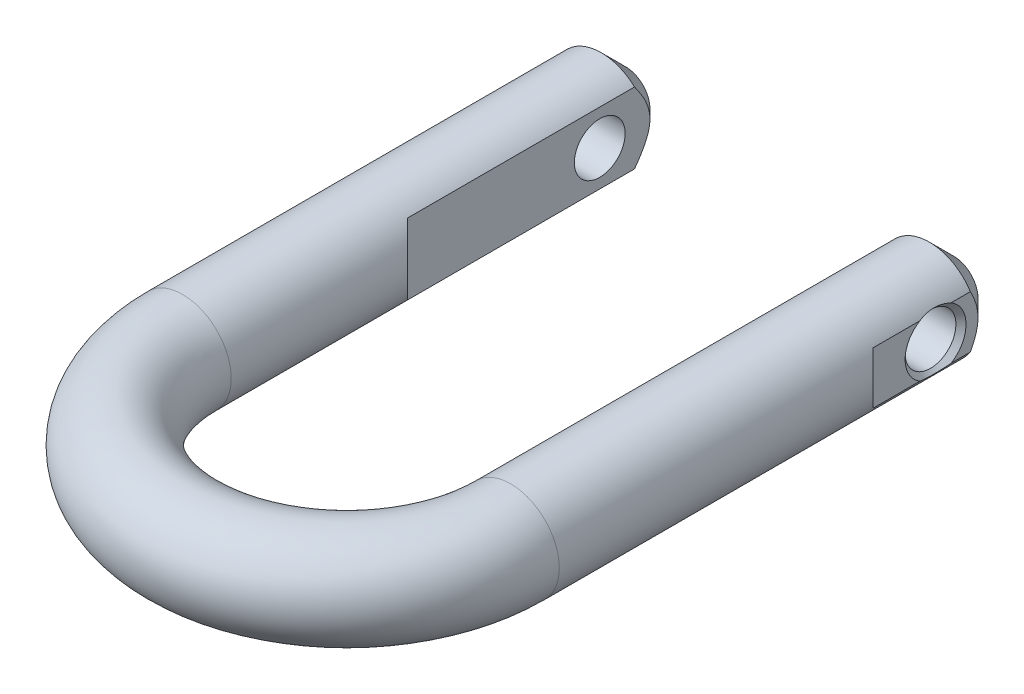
ISO-10303-21;
HEADER;
FILE_DESCRIPTION(('STEP AP214'),'2;1');
FILE_NAME('part.step','',(''),(''),'','','');
FILE_SCHEMA(('AUTOMOTIVE_DESIGN { 1 0 10303 214 1 1 1 1 }'));
ENDSEC;
DATA;
#1=APPLICATION_CONTEXT('core data for automotive mechanical design processes');
#2=APPLICATION_PROTOCOL_DEFINITION('international standard','automotive_design',2000,#1);
#3=PRODUCT_CONTEXT('',#1,'mechanical');
#4=PRODUCT('Part','Part','',(#3));
#5=PRODUCT_RELATED_PRODUCT_CATEGORY('part','',(#4));
#6=PRODUCT_DEFINITION_FORMATION('','',#4);
#7=PRODUCT_DEFINITION_CONTEXT('part definition',#1,'design');
#8=PRODUCT_DEFINITION('design','',#6,#7);
#9=PRODUCT_DEFINITION_SHAPE('','',#8);
#10=(LENGTH_UNIT() NAMED_UNIT(*) SI_UNIT(.MILLI.,.METRE.));
#11=(NAMED_UNIT(*) PLANE_ANGLE_UNIT() SI_UNIT($,.RADIAN.));
#12=(NAMED_UNIT(*) SI_UNIT($,.STERADIAN.) SOLID_ANGLE_UNIT());
#13=UNCERTAINTY_MEASURE_WITH_UNIT(LENGTH_MEASURE(1.E-05),#10,'distance_accuracy_value','');
#14=(GEOMETRIC_REPRESENTATION_CONTEXT(3) GLOBAL_UNCERTAINTY_ASSIGNED_CONTEXT((#13)) GLOBAL_UNIT_ASSIGNED_CONTEXT((#10,
#11,#12)) REPRESENTATION_CONTEXT('',''));
#15=CARTESIAN_POINT('',(0.,0.,0.));
#16=DIRECTION('',(0.,0.,1.));
#17=DIRECTION('',(1.,0.,0.));
#18=AXIS2_PLACEMENT_3D('',#15,#16,#17);
#19=CARTESIAN_POINT('',(13.668375,2.409825,-5.7912));
#20=DIRECTION('',(0.,0.,1.));
#21=DIRECTION('',(0.,-1.,0.));
#22=AXIS2_PLACEMENT_3D('',#19,#20,#21);
#23=PLANE('',#22);
#24=CARTESIAN_POINT('',(16.0782,0.,-5.7912));
#25=DIRECTION('',(0.,0.,1.));
#26=DIRECTION('',(0.,-1.,0.));
#27=AXIS2_PLACEMENT_3D('',#24,#25,#26);
#28=CIRCLE('',#27,2.38125);
#29=CARTESIAN_POINT('',(16.0782,-2.38125,-5.7912));
#30=VERTEX_POINT('',#29);
#31=EDGE_CURVE('E250',#30,#30,#28,.F.);
#32=ORIENTED_EDGE('',*,*,#31,.T.);
#33=EDGE_LOOP('',(#32));
#34=FACE_BOUND('',#33,.T.);
#35=ADVANCED_FACE('F14',(#34),#23,.F.);
#36=CARTESIAN_POINT('',(12.827,0.,0.));
#37=DIRECTION('',(1.,0.,0.));
#38=DIRECTION('',(0.,1.,0.));
#39=AXIS2_PLACEMENT_3D('',#36,#37,#38);
#40=CYLINDRICAL_SURFACE('',#39,2.4892);
#41=CARTESIAN_POINT('',(12.827,0.,0.));
#42=DIRECTION('',(1.,0.,0.));
#43=DIRECTION('',(0.,1.,0.));
#44=AXIS2_PLACEMENT_3D('',#41,#42,#43);
#45=CIRCLE('',#44,2.4892);
#46=CARTESIAN_POINT('',(12.827,2.4892,0.));
#47=VERTEX_POINT('',#46);
#48=EDGE_CURVE('E252',#47,#47,#45,.F.);
#49=ORIENTED_EDGE('',*,*,#48,.T.);
#50=EDGE_LOOP('',(#49));
#51=FACE_BOUND('',#50,.T.);
#52=CARTESIAN_POINT('',(19.5961,0.,0.));
#53=DIRECTION('',(1.,0.,0.));
#54=DIRECTION('',(0.,1.,0.));
#55=AXIS2_PLACEMENT_3D('',#52,#53,#54);
#56=CIRCLE('',#55,2.4892);
#57=CARTESIAN_POINT('',(19.5961,2.4892,0.));
#58=VERTEX_POINT('',#57);
#59=EDGE_CURVE('E276',#58,#58,#56,.F.);
#60=ORIENTED_EDGE('',*,*,#59,.F.);
#61=EDGE_LOOP('',(#60));
#62=FACE_BOUND('',#61,.T.);
#63=ADVANCED_FACE('F215',(#51,#62),#40,.F.);
#64=CARTESIAN_POINT('',(20.8451958,2.5950711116,6.9005958));
#65=DIRECTION('',(-0.707106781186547,0.,0.707106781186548));
#66=DIRECTION('',(-0.707106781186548,0.,-0.707106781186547));
#67=AXIS2_PLACEMENT_3D('',#64,#65,#66);
#68=PLANE('',#67);
#69=DIRECTION('',(0.,1.,0.));
#70=VECTOR('',#69,1.);
#71=CARTESIAN_POINT('',(20.0914,0.,6.1468));
#72=LINE('',#71,#70);
#73=CARTESIAN_POINT('',(20.0914000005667,-2.56429951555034,6.14680000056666));
#74=VERTEX_POINT('',#73);
#75=CARTESIAN_POINT('',(20.0914000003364,2.5642995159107,6.1468000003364));
#76=VERTEX_POINT('',#75);
#77=EDGE_CURVE('E281',#74,#76,#72,.T.);
#78=ORIENTED_EDGE('',*,*,#77,.T.);
#79=CARTESIAN_POINT('',(16.0782,0.,2.1336));
#80=DIRECTION('',(-0.707106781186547,0.,0.707106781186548));
#81=DIRECTION('',(-0.707106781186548,0.,-0.707106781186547));
#82=AXIS2_PLACEMENT_3D('',#79,#80,#81);
#83=ELLIPSE('',#82,6.73519209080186,4.7625);
#84=EDGE_CURVE('E277',#76,#74,#83,.F.);
#85=ORIENTED_EDGE('',*,*,#84,.T.);
#86=EDGE_LOOP('',(#78,#85));
#87=FACE_BOUND('',#86,.T.);
#88=ADVANCED_FACE('F221',(#87),#68,.F.);
#89=CARTESIAN_POINT('',(20.0914,2.5642995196,6.1468));
#90=DIRECTION('',(-1.,0.,0.));
#91=DIRECTION('',(0.,0.,-1.));
#92=AXIS2_PLACEMENT_3D('',#89,#90,#91);
#93=PLANE('',#92);
#94=DIRECTION('',(0.,0.,-1.));
#95=VECTOR('',#94,1.);
#96=CARTESIAN_POINT('',(20.0914000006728,2.56429951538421,17.110075));
#97=LINE('',#96,#95);
#98=CARTESIAN_POINT('',(20.0914000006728,2.564299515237,1.52696046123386));
#99=VERTEX_POINT('',#98);
#100=EDGE_CURVE('E38',#99,#76,#97,.F.);
#101=ORIENTED_EDGE('',*,*,#100,.T.);
#102=ORIENTED_EDGE('',*,*,#77,.F.);
#103=DIRECTION('',(0.,0.,1.));
#104=VECTOR('',#103,1.);
#105=CARTESIAN_POINT('',(20.0914000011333,-2.5642995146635,17.110075));
#106=LINE('',#105,#104);
#107=CARTESIAN_POINT('',(20.0914000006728,-2.56429951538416,1.52696046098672));
#108=VERTEX_POINT('',#107);
#109=EDGE_CURVE('E290',#74,#108,#106,.F.);
#110=ORIENTED_EDGE('',*,*,#109,.T.);
#111=CARTESIAN_POINT('',(20.0914,0.,0.));
#112=DIRECTION('',(1.,0.,0.));
#113=DIRECTION('',(0.,1.,0.));
#114=AXIS2_PLACEMENT_3D('',#111,#112,#113);
#115=CIRCLE('',#114,2.9845);
#116=EDGE_CURVE('E273',#99,#108,#115,.T.);
#117=ORIENTED_EDGE('',*,*,#116,.F.);
#118=EDGE_LOOP('',(#101,#102,#110,#117));
#119=FACE_BOUND('',#118,.T.);
#120=ADVANCED_FACE('F16',(#119),#93,.F.);
#121=CARTESIAN_POINT('',(12.827,3.5218624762,18.8468));
#122=DIRECTION('',(0.707106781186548,0.,0.707106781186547));
#123=DIRECTION('',(-0.707106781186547,0.,0.707106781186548));
#124=AXIS2_PLACEMENT_3D('',#121,#122,#123);
#125=PLANE('',#124);
#126=DIRECTION('',(0.,-1.,0.));
#127=VECTOR('',#126,1.);
#128=CARTESIAN_POINT('',(12.827,0.,18.8468));
#129=LINE('',#128,#127);
#130=CARTESIAN_POINT('',(12.8269999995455,3.48010126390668,18.8468000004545));
#131=VERTEX_POINT('',#130);
#132=CARTESIAN_POINT('',(12.826999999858,-3.48010126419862,18.846800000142));
#133=VERTEX_POINT('',#132);
#134=EDGE_CURVE('E280',#131,#133,#129,.T.);
#135=ORIENTED_EDGE('',*,*,#134,.T.);
#136=CARTESIAN_POINT('',(16.0782,0.,15.5956));
#137=DIRECTION('',(0.707106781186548,0.,0.707106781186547));
#138=DIRECTION('',(0.707106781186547,0.,-0.707106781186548));
#139=AXIS2_PLACEMENT_3D('',#136,#137,#138);
#140=ELLIPSE('',#139,6.73519209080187,4.7625);
#141=EDGE_CURVE('E249',#133,#131,#140,.F.);
#142=ORIENTED_EDGE('',*,*,#141,.T.);
#143=EDGE_LOOP('',(#135,#142));
#144=FACE_BOUND('',#143,.T.);
#145=ADVANCED_FACE('F229',(#144),#125,.F.);
#146=CARTESIAN_POINT('',(12.827,-3.4801012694,-5.0638583));
#147=DIRECTION('',(1.,0.,0.));
#148=DIRECTION('',(0.,1.,0.));
#149=AXIS2_PLACEMENT_3D('',#146,#147,#148);
#150=PLANE('',#149);
#151=ORIENTED_EDGE('',*,*,#48,.F.);
#152=EDGE_LOOP('',(#151));
#153=FACE_BOUND('',#152,.T.);
#154=CARTESIAN_POINT('',(12.827,3.48010126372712,-3.40995000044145));
#155=CARTESIAN_POINT('',(12.827,3.38773784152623,-3.47742310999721));
#156=CARTESIAN_POINT('',(12.827,3.29478867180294,-3.54410995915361));
#157=CARTESIAN_POINT('',(12.827,3.1074763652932,-3.67553917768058));
#158=CARTESIAN_POINT('',(12.827,3.01311271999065,-3.74028082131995));
#159=CARTESIAN_POINT('',(12.827,2.82173414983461,-3.86810709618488));
#160=CARTESIAN_POINT('',(12.827,2.72470138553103,-3.93116515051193));
#161=CARTESIAN_POINT('',(12.827,2.52877191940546,-4.05429781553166));
#162=CARTESIAN_POINT('',(12.827,2.4298754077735,-4.11437272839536));
#163=CARTESIAN_POINT('',(12.827,2.22559252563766,-4.23336682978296));
#164=CARTESIAN_POINT('',(12.827,2.12011039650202,-4.29212385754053));
#165=CARTESIAN_POINT('',(12.827,1.90649956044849,-4.40458723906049));
#166=CARTESIAN_POINT('',(12.827,1.79837030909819,-4.45829254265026));
#167=CARTESIAN_POINT('',(12.827,1.47047438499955,-4.60943288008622));
#168=CARTESIAN_POINT('',(12.827,1.24605500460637,-4.69759048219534));
#169=CARTESIAN_POINT('',(12.827,0.933037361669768,-4.79093836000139));
#170=CARTESIAN_POINT('',(12.827,0.84942988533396,-4.81311953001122));
#171=CARTESIAN_POINT('',(12.827,0.680852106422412,-4.85173790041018));
#172=CARTESIAN_POINT('',(12.827,0.595881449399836,-4.86817358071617));
#173=CARTESIAN_POINT('',(12.827,0.426008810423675,-4.89451826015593));
#174=CARTESIAN_POINT('',(12.827,0.341119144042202,-4.90450596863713));
#175=CARTESIAN_POINT('',(12.827,0.170821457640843,-4.91787236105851));
#176=CARTESIAN_POINT('',(12.827,0.0854134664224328,-4.92125140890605));
#177=CARTESIAN_POINT('',(12.827,-0.0982622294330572,-4.92124837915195));
#178=CARTESIAN_POINT('',(12.827,-0.196531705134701,-4.91677275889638));
#179=CARTESIAN_POINT('',(12.827,-0.392287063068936,-4.89912170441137));
#180=CARTESIAN_POINT('',(12.827,-0.489772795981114,-4.88594465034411));
#181=CARTESIAN_POINT('',(12.827,-0.684678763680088,-4.85134305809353));
#182=CARTESIAN_POINT('',(12.827,-0.782078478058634,-4.82980424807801));
#183=CARTESIAN_POINT('',(12.827,-0.97493945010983,-4.77949498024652));
#184=CARTESIAN_POINT('',(12.827,-1.07040101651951,-4.75072568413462));
#185=CARTESIAN_POINT('',(12.827,-1.3800994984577,-4.64628878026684));
#186=CARTESIAN_POINT('',(12.827,-1.5900157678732,-4.55771605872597));
#187=CARTESIAN_POINT('',(12.827,-1.89730489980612,-4.40920421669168));
#188=CARTESIAN_POINT('',(12.827,-1.99866837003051,-4.3569694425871));
#189=CARTESIAN_POINT('',(12.827,-2.19910194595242,-4.24826122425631));
#190=CARTESIAN_POINT('',(12.827,-2.29817246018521,-4.19178854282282));
#191=CARTESIAN_POINT('',(12.827,-2.49005682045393,-4.07794374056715));
#192=CARTESIAN_POINT('',(12.827,-2.58295652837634,-4.02071469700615));
#193=CARTESIAN_POINT('',(12.827,-2.76713539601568,-3.90369307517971));
#194=CARTESIAN_POINT('',(12.827,-2.85841442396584,-3.84390028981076));
#195=CARTESIAN_POINT('',(12.827,-3.03879750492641,-3.72271319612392));
#196=CARTESIAN_POINT('',(12.827,-3.12791333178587,-3.66133633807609));
#197=CARTESIAN_POINT('',(12.827,-3.30489458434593,-3.53685805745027));
#198=CARTESIAN_POINT('',(12.827,-3.39276037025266,-3.47375714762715));
#199=CARTESIAN_POINT('',(12.827,-3.48010126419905,-3.40995000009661));
#200=B_SPLINE_CURVE_WITH_KNOTS('',3,(#154,#155,#156,#157,#158,#159,#160,#161,#162,#163,#164,
#165,#166,#167,#168,#169,#170,#171,#172,#173,#174,#175,#176,#177,#178,#179,#180,#181,#182,#183,
#184,#185,#186,#187,#188,#189,#190,#191,#192,#193,#194,#195,#196,#197,#198,#199),.UNSPECIFIED.,
.F.,.F.,(4,2,2,2,2,2,2,2,2,2,2,2,2,2,2,2,2,2,2,2,2,2,4),(0.,0.343160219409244,0.686446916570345,
1.03356705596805,1.38065196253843,1.74273745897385,2.10489806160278,2.82521144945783,
3.08455222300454,3.34396155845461,3.60014125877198,3.85630685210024,4.15100748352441,
4.44576299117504,4.74469708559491,5.0435831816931,5.72492175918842,6.06698242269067,
6.40898166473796,6.7362759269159,7.06359667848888,7.38819581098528,7.71269943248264),.UNSPECIFIED.);
#201=CARTESIAN_POINT('',(12.8269999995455,3.48010126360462,-3.40995000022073));
#202=VERTEX_POINT('',#201);
#203=CARTESIAN_POINT('',(12.826999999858,-3.48010126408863,-3.40995000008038));
#204=VERTEX_POINT('',#203);
#205=EDGE_CURVE('E68',#202,#204,#200,.T.);
#206=ORIENTED_EDGE('',*,*,#205,.T.);
#207=DIRECTION('',(0.,0.,-1.));
#208=VECTOR('',#207,1.);
#209=CARTESIAN_POINT('',(12.8269999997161,-3.48010126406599,17.110075));
#210=LINE('',#209,#208);
#211=EDGE_CURVE('E248',#204,#133,#210,.F.);
#212=ORIENTED_EDGE('',*,*,#211,.T.);
#213=ORIENTED_EDGE('',*,*,#134,.F.);
#214=DIRECTION('',(0.,0.,1.));
#215=VECTOR('',#214,1.);
#216=CARTESIAN_POINT('',(12.8269999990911,3.48010126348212,17.110075));
#217=LINE('',#216,#215);
#218=EDGE_CURVE('E289',#131,#202,#217,.F.);
#219=ORIENTED_EDGE('',*,*,#218,.T.);
#220=EDGE_LOOP('',(#206,#212,#213,#219));
#221=FACE_BOUND('',#220,.T.);
#222=ADVANCED_FACE('F232',(#153,#221),#150,.F.);
#223=CARTESIAN_POINT('',(16.0782,0.,-5.7912));
#224=DIRECTION('',(0.,0.,1.));
#225=DIRECTION('',(0.,-1.,0.));
#226=AXIS2_PLACEMENT_3D('',#223,#224,#225);
#227=CONICAL_SURFACE('',#226,2.38125,0.785398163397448);
#228=ORIENTED_EDGE('',*,*,#31,.F.);
#229=EDGE_LOOP('',(#228));
#230=FACE_BOUND('',#229,.T.);
#231=CARTESIAN_POINT('',(16.0782,0.,-3.40995));
#232=DIRECTION('',(0.,0.,-1.));
#233=DIRECTION('',(1.,0.,0.));
#234=AXIS2_PLACEMENT_3D('',#231,#232,#233);
#235=CIRCLE('',#234,4.7625);
#236=CARTESIAN_POINT('',(20.0914000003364,2.56429951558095,-3.40995000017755));
#237=VERTEX_POINT('',#236);
#238=EDGE_CURVE('E269',#202,#237,#235,.T.);
#239=ORIENTED_EDGE('',*,*,#238,.T.);
#240=CARTESIAN_POINT('',(20.0914000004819,2.56429951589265,-3.40995000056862));
#241=CARTESIAN_POINT('',(20.0914000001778,2.49378151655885,-3.44791517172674));
#242=CARTESIAN_POINT('',(20.0914000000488,2.422803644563,-3.48502454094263));
#243=CARTESIAN_POINT('',(20.0913999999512,2.27983916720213,-3.55729805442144));
#244=CARTESIAN_POINT('',(20.0913999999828,2.20785226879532,-3.59246161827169));
#245=CARTESIAN_POINT('',(20.0914000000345,1.98970847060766,-3.69493126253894));
#246=CARTESIAN_POINT('',(20.0914000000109,1.84195014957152,-3.75889838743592));
#247=CARTESIAN_POINT('',(20.0913999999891,1.54094089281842,-3.87583237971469));
#248=CARTESIAN_POINT('',(20.0913999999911,1.38765967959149,-3.92872230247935));
#249=CARTESIAN_POINT('',(20.0914000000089,1.07703016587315,-4.01988133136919));
#250=CARTESIAN_POINT('',(20.0914000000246,0.919690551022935,-4.05817927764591));
#251=CARTESIAN_POINT('',(20.0913999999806,0.635154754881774,-4.11117368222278));
#252=CARTESIAN_POINT('',(20.0913999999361,0.508569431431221,-4.12913799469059));
#253=CARTESIAN_POINT('',(20.0914000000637,0.254652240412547,-4.15315671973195));
#254=CARTESIAN_POINT('',(20.0914000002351,0.127324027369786,-4.15924882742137));
#255=CARTESIAN_POINT('',(20.091400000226,-0.121751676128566,-4.15925112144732));
#256=CARTESIAN_POINT('',(20.0914000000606,-0.243499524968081,-4.15368278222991));
#257=CARTESIAN_POINT('',(20.0913999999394,-0.486054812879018,-4.1317292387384));
#258=CARTESIAN_POINT('',(20.0913999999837,-0.60686182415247,-4.11533937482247));
#259=CARTESIAN_POINT('',(20.0914000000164,-0.847410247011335,-4.07247759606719));
#260=CARTESIAN_POINT('',(20.0914000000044,-0.967140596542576,-4.04594453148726));
#261=CARTESIAN_POINT('',(20.0913999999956,-1.20429124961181,-3.98401630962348));
#262=CARTESIAN_POINT('',(20.0913999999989,-1.32171096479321,-3.9486189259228));
#263=CARTESIAN_POINT('',(20.0914000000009,-1.53586247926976,-3.87639055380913));
#264=CARTESIAN_POINT('',(20.0914000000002,-1.63296519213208,-3.84064375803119));
#265=CARTESIAN_POINT('',(20.0913999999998,-1.82533784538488,-3.76452187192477));
#266=CARTESIAN_POINT('',(20.0913999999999,-1.92060768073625,-3.72414651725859));
#267=CARTESIAN_POINT('',(20.0914000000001,-2.10823314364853,-3.63995983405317));
#268=CARTESIAN_POINT('',(20.0914,-2.20061001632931,-3.59619550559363));
#269=CARTESIAN_POINT('',(20.0914,-2.38367777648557,-3.50539385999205));
#270=CARTESIAN_POINT('',(20.0913999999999,-2.47436961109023,-3.45835845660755));
#271=CARTESIAN_POINT('',(20.0914,-2.56429951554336,-3.40995000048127));
#272=B_SPLINE_CURVE_WITH_KNOTS('',3,(#240,#241,#242,#243,#244,#245,#246,#247,#248,#249,#250,
#251,#252,#253,#254,#255,#256,#257,#258,#259,#260,#261,#262,#263,#264,#265,#266,#267,#268,#269,
#270,#271),.UNSPECIFIED.,.F.,.F.,(4,2,2,2,2,2,2,2,2,2,2,2,2,2,2,4),(0.,0.240253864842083,
0.480579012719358,0.963215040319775,1.4490998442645,1.9340192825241,2.31707458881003,
2.69891167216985,3.06403761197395,3.42932087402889,3.7968419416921,4.16445541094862,
4.47474712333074,4.78505656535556,5.0916455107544,5.39805656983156),.UNSPECIFIED.);
#273=CARTESIAN_POINT('',(20.0914000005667,-2.56429951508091,-3.40995000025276));
#274=VERTEX_POINT('',#273);
#275=EDGE_CURVE('E261',#237,#274,#272,.T.);
#276=ORIENTED_EDGE('',*,*,#275,.T.);
#277=CARTESIAN_POINT('',(16.0782,0.,-3.40995));
#278=DIRECTION('',(0.,0.,-1.));
#279=DIRECTION('',(1.,0.,0.));
#280=AXIS2_PLACEMENT_3D('',#277,#278,#279);
#281=CIRCLE('',#280,4.7625);
#282=EDGE_CURVE('E268',#274,#204,#281,.T.);
#283=ORIENTED_EDGE('',*,*,#282,.T.);
#284=ORIENTED_EDGE('',*,*,#205,.F.);
#285=EDGE_LOOP('',(#239,#276,#283,#284));
#286=FACE_BOUND('',#285,.T.);
#287=ADVANCED_FACE('F236',(#230,#286),#227,.T.);
#288=CARTESIAN_POINT('',(20.0914,2.5642995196,-1.5111667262));
#289=DIRECTION('',(-1.,0.,0.));
#290=DIRECTION('',(0.,0.,-1.));
#291=AXIS2_PLACEMENT_3D('',#288,#289,#290);
#292=PLANE('',#291);
#293=DIRECTION('',(0.,0.,-1.));
#294=VECTOR('',#293,1.);
#295=CARTESIAN_POINT('',(20.0914000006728,2.56429951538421,17.110075));
#296=LINE('',#295,#294);
#297=CARTESIAN_POINT('',(20.0914000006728,2.56429951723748,-1.52696045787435));
#298=VERTEX_POINT('',#297);
#299=EDGE_CURVE('E74',#237,#298,#296,.F.);
#300=ORIENTED_EDGE('',*,*,#299,.T.);
#301=CARTESIAN_POINT('',(20.0914,0.,0.));
#302=DIRECTION('',(1.,0.,0.));
#303=DIRECTION('',(0.,1.,0.));
#304=AXIS2_PLACEMENT_3D('',#301,#302,#303);
#305=CIRCLE('',#304,2.9845);
#306=CARTESIAN_POINT('',(20.0914000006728,-2.56429951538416,-1.5269604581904));
#307=VERTEX_POINT('',#306);
#308=EDGE_CURVE('E270',#307,#298,#305,.T.);
#309=ORIENTED_EDGE('',*,*,#308,.F.);
#310=DIRECTION('',(0.,0.,1.));
#311=VECTOR('',#310,1.);
#312=CARTESIAN_POINT('',(20.0914000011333,-2.5642995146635,17.110075));
#313=LINE('',#312,#311);
#314=EDGE_CURVE('E286',#307,#274,#313,.F.);
#315=ORIENTED_EDGE('',*,*,#314,.T.);
#316=ORIENTED_EDGE('',*,*,#275,.F.);
#317=EDGE_LOOP('',(#300,#309,#315,#316));
#318=FACE_BOUND('',#317,.T.);
#319=ADVANCED_FACE('F238',(#318),#292,.F.);
#320=CARTESIAN_POINT('',(19.5961,0.,0.));
#321=DIRECTION('',(1.,0.,0.));
#322=DIRECTION('',(0.,1.,0.));
#323=AXIS2_PLACEMENT_3D('',#320,#321,#322);
#324=CONICAL_SURFACE('',#323,2.4892,0.785398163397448);
#325=ORIENTED_EDGE('',*,*,#59,.T.);
#326=EDGE_LOOP('',(#325));
#327=FACE_BOUND('',#326,.T.);
#328=ORIENTED_EDGE('',*,*,#116,.T.);
#329=CARTESIAN_POINT('',(20.0914000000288,-2.56429951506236,1.52696046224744));
#330=CARTESIAN_POINT('',(20.0677153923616,-2.60132497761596,1.41853086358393));
#331=CARTESIAN_POINT('',(20.0459574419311,-2.63428539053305,1.3082701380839));
#332=CARTESIAN_POINT('',(20.0070207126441,-2.69203403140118,1.08470350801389));
#333=CARTESIAN_POINT('',(19.9898471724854,-2.71681291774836,0.971394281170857));
#334=CARTESIAN_POINT('',(19.961006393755,-2.75786688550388,0.743734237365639));
#335=CARTESIAN_POINT('',(19.9492861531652,-2.77422399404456,0.629404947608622));
#336=CARTESIAN_POINT('',(19.9316273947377,-2.79870301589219,0.399507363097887));
#337=CARTESIAN_POINT('',(19.9256833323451,-2.80683282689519,0.283940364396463));
#338=CARTESIAN_POINT('',(19.9220515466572,-2.81179855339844,0.140193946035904));
#339=CARTESIAN_POINT('',(19.9215207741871,-2.81252412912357,0.112176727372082));
#340=CARTESIAN_POINT('',(19.9208120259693,-2.81349240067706,0.0561072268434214));
#341=CARTESIAN_POINT('',(19.9206343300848,-2.81373471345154,0.0280549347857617));
#342=CARTESIAN_POINT('',(19.9206357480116,-2.81373422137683,-0.111719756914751));
#343=CARTESIAN_POINT('',(19.9234592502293,-2.80988972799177,-0.223481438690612));
#344=CARTESIAN_POINT('',(19.9346359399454,-2.79452961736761,-0.446258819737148));
#345=CARTESIAN_POINT('',(19.9429933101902,-2.78300819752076,-0.557273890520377));
#346=CARTESIAN_POINT('',(19.9648867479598,-2.75234923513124,-0.77777884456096));
#347=CARTESIAN_POINT('',(19.9784251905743,-2.73320819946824,-0.887268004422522));
#348=CARTESIAN_POINT('',(20.0101367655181,-2.68738808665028,-1.10396567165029));
#349=CARTESIAN_POINT('',(20.0283091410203,-2.66071024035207,-1.21117454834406));
#350=CARTESIAN_POINT('',(20.0551938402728,-2.62012855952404,-1.35228504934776));
#351=CARTESIAN_POINT('',(20.062156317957,-2.60953456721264,-1.38750434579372));
#352=CARTESIAN_POINT('',(20.0764820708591,-2.58753146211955,-1.45752898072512));
#353=CARTESIAN_POINT('',(20.0838445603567,-2.57612393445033,-1.49233497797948));
#354=CARTESIAN_POINT('',(20.0913999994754,-2.56429951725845,-1.52696045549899));
#355=B_SPLINE_CURVE_WITH_KNOTS('',3,(#329,#330,#331,#332,#333,#334,#335,#336,#337,#338,#339,
#340,#341,#342,#343,#344,#345,#346,#347,#348,#349,#350,#351,#352,#353,#354),.UNSPECIFIED.,.F.,
.F.,(4,2,2,2,2,2,2,2,2,2,2,2,4),(0.,0.350931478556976,0.702262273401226,1.05010314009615,
1.39760978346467,1.48170105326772,1.56585895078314,1.90099069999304,2.23637604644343,
2.57191532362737,2.90739983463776,3.01968451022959,3.13175608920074),.UNSPECIFIED.);
#356=EDGE_CURVE('E272',#108,#307,#355,.T.);
#357=ORIENTED_EDGE('',*,*,#356,.T.);
#358=ORIENTED_EDGE('',*,*,#308,.T.);
#359=CARTESIAN_POINT('',(20.0913999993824,2.56429951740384,-1.52696045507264));
#360=CARTESIAN_POINT('',(20.067715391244,2.60132497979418,-1.41853085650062));
#361=CARTESIAN_POINT('',(20.0459574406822,2.63428539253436,-1.3082701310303));
#362=CARTESIAN_POINT('',(20.0070207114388,2.69203403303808,-1.08470350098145));
#363=CARTESIAN_POINT('',(19.9898471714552,2.7168129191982,-0.971394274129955));
#364=CARTESIAN_POINT('',(19.9610063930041,2.75786688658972,-0.743734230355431));
#365=CARTESIAN_POINT('',(19.9492861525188,2.77422399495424,-0.629404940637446));
#366=CARTESIAN_POINT('',(19.9316273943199,2.79870301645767,-0.399507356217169));
#367=CARTESIAN_POINT('',(19.9256833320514,2.80683282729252,-0.283940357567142));
#368=CARTESIAN_POINT('',(19.9220515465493,2.81179855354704,-0.140193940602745));
#369=CARTESIAN_POINT('',(19.9215207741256,2.81252412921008,-0.112176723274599));
#370=CARTESIAN_POINT('',(19.9208120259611,2.81349240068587,-0.056107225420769));
#371=CARTESIAN_POINT('',(19.9206343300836,2.8137347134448,-0.0280549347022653));
#372=CARTESIAN_POINT('',(19.9206357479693,2.81373422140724,0.111719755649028));
#373=CARTESIAN_POINT('',(19.923459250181,2.80988972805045,0.223481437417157));
#374=CARTESIAN_POINT('',(19.9346359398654,2.79452961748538,0.446258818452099));
#375=CARTESIAN_POINT('',(19.9429933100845,2.7830081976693,0.55727388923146));
#376=CARTESIAN_POINT('',(19.9648867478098,2.7523492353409,0.777778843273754));
#377=CARTESIAN_POINT('',(19.9784251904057,2.73320819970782,0.887268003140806));
#378=CARTESIAN_POINT('',(20.0101367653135,2.68738808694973,1.10396567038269));
#379=CARTESIAN_POINT('',(20.0283091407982,2.66071024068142,1.21117454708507));
#380=CARTESIAN_POINT('',(20.055193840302,2.62012855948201,1.35228504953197));
#381=CARTESIAN_POINT('',(20.0621563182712,2.6095345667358,1.3875043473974));
#382=CARTESIAN_POINT('',(20.076482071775,2.58753146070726,1.45752898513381));
#383=CARTESIAN_POINT('',(20.083844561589,2.5761239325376,1.4923349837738));
#384=CARTESIAN_POINT('',(20.0914000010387,2.56429951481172,1.52696046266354));
#385=B_SPLINE_CURVE_WITH_KNOTS('',3,(#359,#360,#361,#362,#363,#364,#365,#366,#367,#368,#369,
#370,#371,#372,#373,#374,#375,#376,#377,#378,#379,#380,#381,#382,#383,#384),.UNSPECIFIED.,.F.,
.F.,(4,2,2,2,2,2,2,2,2,2,2,2,4),(0.,0.35093147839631,0.702262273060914,1.05010313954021,
1.39760978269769,1.48170104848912,1.56585894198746,1.90099069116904,2.23637603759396,
2.57191531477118,2.90739982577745,3.01968450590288,3.13175608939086),.UNSPECIFIED.);
#386=EDGE_CURVE('E18',#298,#99,#385,.T.);
#387=ORIENTED_EDGE('',*,*,#386,.T.);
#388=EDGE_LOOP('',(#328,#357,#358,#387));
#389=FACE_BOUND('',#388,.T.);
#390=ADVANCED_FACE('F258',(#327,#389),#324,.F.);
#391=CARTESIAN_POINT('',(16.0782,0.,37.6301));
#392=DIRECTION('',(0.,0.,-1.));
#393=DIRECTION('',(0.,1.,0.));
#394=AXIS2_PLACEMENT_3D('',#391,#392,#393);
#395=CYLINDRICAL_SURFACE('',#394,4.7625);
#396=CARTESIAN_POINT('',(16.0782,0.,37.6301));
#397=DIRECTION('',(0.,0.,-1.));
#398=DIRECTION('',(0.,1.,0.));
#399=AXIS2_PLACEMENT_3D('',#396,#397,#398);
#400=CIRCLE('',#399,4.7625);
#401=CARTESIAN_POINT('',(20.8407000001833,0.,37.6301));
#402=VERTEX_POINT('',#401);
#403=EDGE_CURVE('E9',#402,#402,#400,.F.);
#404=ORIENTED_EDGE('',*,*,#403,.F.);
#405=EDGE_LOOP('',(#404));
#406=FACE_BOUND('',#405,.T.);
#407=ORIENTED_EDGE('',*,*,#386,.F.);
#408=ORIENTED_EDGE('',*,*,#299,.F.);
#409=ORIENTED_EDGE('',*,*,#238,.F.);
#410=ORIENTED_EDGE('',*,*,#218,.F.);
#411=ORIENTED_EDGE('',*,*,#141,.F.);
#412=ORIENTED_EDGE('',*,*,#211,.F.);
#413=ORIENTED_EDGE('',*,*,#282,.F.);
#414=ORIENTED_EDGE('',*,*,#314,.F.);
#415=ORIENTED_EDGE('',*,*,#356,.F.);
#416=ORIENTED_EDGE('',*,*,#109,.F.);
#417=ORIENTED_EDGE('',*,*,#84,.F.);
#418=ORIENTED_EDGE('',*,*,#100,.F.);
#419=EDGE_LOOP('',(#407,#408,#409,#410,#411,#412,#413,#414,#415,#416,#417,#418));
#420=FACE_BOUND('',#419,.T.);
#421=ADVANCED_FACE('F256',(#406,#420),#395,.T.);
#422=CARTESIAN_POINT('',(0.,0.,37.6301));
#423=DIRECTION('',(0.,1.,0.));
#424=DIRECTION('',(0.,0.,1.));
#425=AXIS2_PLACEMENT_3D('',#422,#423,#424);
#426=TOROIDAL_SURFACE('',#425,16.0782,4.76250000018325);
#427=CARTESIAN_POINT('',(-16.0782,0.,37.6301));
#428=DIRECTION('',(0.,0.,-1.));
#429=DIRECTION('',(-1.,0.,0.));
#430=AXIS2_PLACEMENT_3D('',#427,#428,#429);
#431=CIRCLE('',#430,4.76250000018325);
#432=CARTESIAN_POINT('',(-20.8407000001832,0.,37.6301));
#433=VERTEX_POINT('',#432);
#434=EDGE_CURVE('E173',#433,#433,#431,.T.);
#435=CARTESIAN_POINT('',(0.,0.,37.6301));
#436=DIRECTION('',(0.,1.,0.));
#437=DIRECTION('',(0.,0.,1.));
#438=AXIS2_PLACEMENT_3D('',#435,#436,#437);
#439=CIRCLE('',#438,20.8407000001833);
#440=EDGE_CURVE('',#433,#402,#439,.T.);
#441=ORIENTED_EDGE('',*,*,#434,.F.);
#442=ORIENTED_EDGE('',*,*,#403,.T.);
#443=ORIENTED_EDGE('',*,*,#440,.T.);
#444=ORIENTED_EDGE('',*,*,#440,.F.);
#445=EDGE_LOOP('',(#441,#443,#442,#444));
#446=FACE_BOUND('',#445,.T.);
#447=ADVANCED_FACE('F197',(#446),#426,.T.);
#448=CARTESIAN_POINT('',(-20.0914,2.5642995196,1.4992414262));
#449=DIRECTION('',(1.,0.,0.));
#450=DIRECTION('',(0.,0.,1.));
#451=AXIS2_PLACEMENT_3D('',#448,#449,#450);
#452=PLANE('',#451);
#453=CARTESIAN_POINT('',(-20.0914,0.,0.));
#454=DIRECTION('',(-1.,0.,0.));
#455=DIRECTION('',(0.,-1.,0.));
#456=AXIS2_PLACEMENT_3D('',#453,#454,#455);
#457=CIRCLE('',#456,2.9845);
#458=CARTESIAN_POINT('',(-20.0914,-2.56429951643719,1.52696045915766));
#459=VERTEX_POINT('',#458);
#460=CARTESIAN_POINT('',(-20.0914,2.56429951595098,1.52696045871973));
#461=VERTEX_POINT('',#460);
#462=EDGE_CURVE('E130',#459,#461,#457,.T.);
#463=ORIENTED_EDGE('',*,*,#462,.F.);
#464=DIRECTION('',(0.,0.,-1.));
#465=VECTOR('',#464,1.);
#466=CARTESIAN_POINT('',(-20.0914,-2.5642995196,3.8230207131));
#467=LINE('',#466,#465);
#468=CARTESIAN_POINT('',(-20.0914,-2.5642995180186,6.1468));
#469=VERTEX_POINT('',#468);
#470=EDGE_CURVE('E116',#469,#459,#467,.T.);
#471=ORIENTED_EDGE('',*,*,#470,.F.);
#472=DIRECTION('',(0.,-1.,0.));
#473=VECTOR('',#472,1.);
#474=CARTESIAN_POINT('',(-20.0914,0.,6.1468));
#475=LINE('',#474,#473);
#476=CARTESIAN_POINT('',(-20.0914,2.56429951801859,6.1468));
#477=VERTEX_POINT('',#476);
#478=EDGE_CURVE('E332',#477,#469,#475,.T.);
#479=ORIENTED_EDGE('',*,*,#478,.F.);
#480=DIRECTION('',(0.,0.,1.));
#481=VECTOR('',#480,1.);
#482=CARTESIAN_POINT('',(-20.0914,2.5642995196,3.8230207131));
#483=LINE('',#482,#481);
#484=EDGE_CURVE('E127',#461,#477,#483,.T.);
#485=ORIENTED_EDGE('',*,*,#484,.F.);
#486=EDGE_LOOP('',(#463,#471,#479,#485));
#487=FACE_BOUND('',#486,.T.);
#488=ADVANCED_FACE('F131',(#487),#452,.F.);
#489=CARTESIAN_POINT('',(-13.668375,2.409825,-5.7912));
#490=DIRECTION('',(0.,0.,-1.));
#491=DIRECTION('',(0.,-1.,0.));
#492=AXIS2_PLACEMENT_3D('',#489,#490,#491);
#493=PLANE('',#492);
#494=CARTESIAN_POINT('',(-16.0782,0.,-5.7912));
#495=DIRECTION('',(0.,0.,1.));
#496=DIRECTION('',(0.,-1.,0.));
#497=AXIS2_PLACEMENT_3D('',#494,#495,#496);
#498=CIRCLE('',#497,2.38125);
#499=CARTESIAN_POINT('',(-16.0782,-2.38125,-5.7912));
#500=VERTEX_POINT('',#499);
#501=EDGE_CURVE('E349',#500,#500,#498,.F.);
#502=ORIENTED_EDGE('',*,*,#501,.T.);
#503=EDGE_LOOP('',(#502));
#504=FACE_BOUND('',#503,.T.);
#505=ADVANCED_FACE('F196',(#504),#493,.T.);
#506=CARTESIAN_POINT('',(-11.3066322,3.5218624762,20.3671678));
#507=DIRECTION('',(-0.707106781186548,0.,0.707106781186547));
#508=DIRECTION('',(-0.707106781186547,0.,-0.707106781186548));
#509=AXIS2_PLACEMENT_3D('',#506,#507,#508);
#510=PLANE('',#509);
#511=CARTESIAN_POINT('',(-16.0782,0.,15.5956));
#512=DIRECTION('',(-0.707106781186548,0.,0.707106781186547));
#513=DIRECTION('',(-0.707106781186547,0.,-0.707106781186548));
#514=AXIS2_PLACEMENT_3D('',#511,#512,#513);
#515=ELLIPSE('',#514,6.73519209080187,4.7625);
#516=CARTESIAN_POINT('',(-12.827,3.48010126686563,18.8468));
#517=VERTEX_POINT('',#516);
#518=CARTESIAN_POINT('',(-12.827,-3.48010126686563,18.8468));
#519=VERTEX_POINT('',#518);
#520=EDGE_CURVE('E324',#517,#519,#515,.F.);
#521=ORIENTED_EDGE('',*,*,#520,.T.);
#522=DIRECTION('',(0.,1.,0.));
#523=VECTOR('',#522,1.);
#524=CARTESIAN_POINT('',(-12.827,0.,18.8468));
#525=LINE('',#524,#523);
#526=EDGE_CURVE('E321',#519,#517,#525,.T.);
#527=ORIENTED_EDGE('',*,*,#526,.T.);
#528=EDGE_LOOP('',(#521,#527));
#529=FACE_BOUND('',#528,.T.);
#530=ADVANCED_FACE('F192',(#529),#510,.F.);
#531=CARTESIAN_POINT('',(-12.827,3.4801012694,-5.0638583));
#532=DIRECTION('',(-1.,0.,0.));
#533=DIRECTION('',(0.,-1.,0.));
#534=AXIS2_PLACEMENT_3D('',#531,#532,#533);
#535=PLANE('',#534);
#536=CARTESIAN_POINT('',(-12.827,0.,0.));
#537=DIRECTION('',(-1.,0.,0.));
#538=DIRECTION('',(0.,-1.,0.));
#539=AXIS2_PLACEMENT_3D('',#536,#537,#538);
#540=CIRCLE('',#539,2.4892);
#541=CARTESIAN_POINT('',(-12.827,-2.4892,0.));
#542=VERTEX_POINT('',#541);
#543=EDGE_CURVE('E311',#542,#542,#540,.F.);
#544=ORIENTED_EDGE('',*,*,#543,.F.);
#545=EDGE_LOOP('',(#544));
#546=FACE_BOUND('',#545,.T.);
#547=ORIENTED_EDGE('',*,*,#526,.F.);
#548=DIRECTION('',(0.,0.,1.));
#549=VECTOR('',#548,1.);
#550=CARTESIAN_POINT('',(-12.827,-3.4801012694,6.89147085));
#551=LINE('',#550,#549);
#552=CARTESIAN_POINT('',(-12.827,-3.48010126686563,-3.40994999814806));
#553=VERTEX_POINT('',#552);
#554=EDGE_CURVE('E314',#553,#519,#551,.T.);
#555=ORIENTED_EDGE('',*,*,#554,.F.);
#556=CARTESIAN_POINT('',(-12.8269999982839,3.48010126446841,-3.40995000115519));
#557=CARTESIAN_POINT('',(-12.8269999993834,3.38773784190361,-3.47742311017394));
#558=CARTESIAN_POINT('',(-12.8269999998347,3.29478867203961,-3.54410995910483));
#559=CARTESIAN_POINT('',(-12.8270000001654,3.10747636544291,-3.67553917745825));
#560=CARTESIAN_POINT('',(-12.8270000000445,3.01311272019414,-3.74028082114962));
#561=CARTESIAN_POINT('',(-12.826999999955,2.82173415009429,-3.86810709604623));
#562=CARTESIAN_POINT('',(-12.8269999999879,2.72470138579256,-3.93116515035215));
#563=CARTESIAN_POINT('',(-12.8270000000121,2.52877191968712,-4.05429781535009));
#564=CARTESIAN_POINT('',(-12.8270000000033,2.42987540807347,-4.11437272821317));
#565=CARTESIAN_POINT('',(-12.8269999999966,2.22559252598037,-4.23336682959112));
#566=CARTESIAN_POINT('',(-12.8269999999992,2.12011039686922,-4.29212385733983));
#567=CARTESIAN_POINT('',(-12.8270000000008,1.90649956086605,-4.40458723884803));
#568=CARTESIAN_POINT('',(-12.8269999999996,1.79837030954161,-4.45829254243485));
#569=CARTESIAN_POINT('',(-12.8270000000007,1.47047438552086,-4.60943287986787));
#570=CARTESIAN_POINT('',(-12.8270000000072,1.24605500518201,-4.69759048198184));
#571=CARTESIAN_POINT('',(-12.8269999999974,0.933037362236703,-4.79093835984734));
#572=CARTESIAN_POINT('',(-12.826999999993,0.849429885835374,-4.81311952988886));
#573=CARTESIAN_POINT('',(-12.827000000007,0.680852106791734,-4.85173790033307));
#574=CARTESIAN_POINT('',(-12.8270000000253,0.595881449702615,-4.86817358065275));
#575=CARTESIAN_POINT('',(-12.826999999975,0.426008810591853,-4.89451826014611));
#576=CARTESIAN_POINT('',(-12.8269999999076,0.34111914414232,-4.90450596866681));
#577=CARTESIAN_POINT('',(-12.8270000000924,0.170821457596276,-4.91787236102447));
#578=CARTESIAN_POINT('',(-12.8270000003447,0.0854134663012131,-4.92125140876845));
#579=CARTESIAN_POINT('',(-12.8270000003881,-0.0982622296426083,-4.92124837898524));
#580=CARTESIAN_POINT('',(-12.8270000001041,-0.196531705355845,-4.91677275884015));
#581=CARTESIAN_POINT('',(-12.8269999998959,-0.392287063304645,-4.8991217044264));
#582=CARTESIAN_POINT('',(-12.8269999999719,-0.489772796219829,-4.88594465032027));
#583=CARTESIAN_POINT('',(-12.8270000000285,-0.68467876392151,-4.85134305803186));
#584=CARTESIAN_POINT('',(-12.8270000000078,-0.78207847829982,-4.82980424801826));
#585=CARTESIAN_POINT('',(-12.8269999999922,-0.974939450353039,-4.77949498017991));
#586=CARTESIAN_POINT('',(-12.8269999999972,-1.07040101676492,-4.750725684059));
#587=CARTESIAN_POINT('',(-12.8270000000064,-1.38009949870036,-4.64628878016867));
#588=CARTESIAN_POINT('',(-12.8270000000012,-1.59001576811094,-4.55771605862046));
#589=CARTESIAN_POINT('',(-12.8269999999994,-1.89730490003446,-4.40920421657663));
#590=CARTESIAN_POINT('',(-12.8269999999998,-1.99866837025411,-4.3569694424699));
#591=CARTESIAN_POINT('',(-12.8270000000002,-2.19910194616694,-4.24826122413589));
#592=CARTESIAN_POINT('',(-12.827,-2.2981724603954,-4.19178854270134));
#593=CARTESIAN_POINT('',(-12.827,-2.4900568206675,-4.07794374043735));
#594=CARTESIAN_POINT('',(-12.827,-2.58295652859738,-4.02071469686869));
#595=CARTESIAN_POINT('',(-12.827,-2.76713539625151,-3.90369307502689));
#596=CARTESIAN_POINT('',(-12.827,-2.85841442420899,-3.84390028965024));
#597=CARTESIAN_POINT('',(-12.827,-3.03879750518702,-3.72271319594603));
#598=CARTESIAN_POINT('',(-12.827,-3.12791333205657,-3.66133633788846));
#599=CARTESIAN_POINT('',(-12.827,-3.30489458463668,-3.53685805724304));
#600=CARTESIAN_POINT('',(-12.827,-3.39276037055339,-3.47375714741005));
#601=CARTESIAN_POINT('',(-12.827,-3.4801012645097,-3.40994999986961));
#602=B_SPLINE_CURVE_WITH_KNOTS('',3,(#556,#557,#558,#559,#560,#561,#562,#563,#564,#565,#566,
#567,#568,#569,#570,#571,#572,#573,#574,#575,#576,#577,#578,#579,#580,#581,#582,#583,#584,#585,
#586,#587,#588,#589,#590,#591,#592,#593,#594,#595,#596,#597,#598,#599,#600,#601),.UNSPECIFIED.,
.F.,.F.,(4,2,2,2,2,2,2,2,2,2,2,2,2,2,2,2,2,2,2,2,2,2,4),(0.,0.343160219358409,0.686446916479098,
1.03356705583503,1.38065196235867,1.74273745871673,2.10489806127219,2.825211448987,
3.0845522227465,3.34396155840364,3.60014125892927,3.85630685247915,4.15100748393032,
4.44576299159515,4.74469708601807,5.04358318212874,5.72492175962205,6.0669824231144,
6.40898166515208,6.73627592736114,7.06359667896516,7.38819581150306,7.71269943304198),.UNSPECIFIED.);
#603=CARTESIAN_POINT('',(-12.827,3.48010126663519,-3.40995000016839));
#604=VERTEX_POINT('',#603);
#605=EDGE_CURVE('E176',#604,#553,#602,.T.);
#606=ORIENTED_EDGE('',*,*,#605,.F.);
#607=DIRECTION('',(0.,0.,-1.));
#608=VECTOR('',#607,1.);
#609=CARTESIAN_POINT('',(-12.827,3.4801012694,6.89147085));
#610=LINE('',#609,#608);
#611=EDGE_CURVE('E143',#517,#604,#610,.T.);
#612=ORIENTED_EDGE('',*,*,#611,.F.);
#613=EDGE_LOOP('',(#547,#555,#606,#612));
#614=FACE_BOUND('',#613,.T.);
#615=ADVANCED_FACE('F188',(#546,#614),#535,.F.);
#616=CARTESIAN_POINT('',(-16.0782,0.,-5.7912));
#617=DIRECTION('',(0.,0.,1.));
#618=DIRECTION('',(0.,-1.,0.));
#619=AXIS2_PLACEMENT_3D('',#616,#617,#618);
#620=CONICAL_SURFACE('',#619,2.38125,0.785398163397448);
#621=ORIENTED_EDGE('',*,*,#501,.F.);
#622=EDGE_LOOP('',(#621));
#623=FACE_BOUND('',#622,.T.);
#624=CARTESIAN_POINT('',(-16.0782,0.,-3.40995));
#625=DIRECTION('',(0.,0.,-1.));
#626=DIRECTION('',(1.,0.,0.));
#627=AXIS2_PLACEMENT_3D('',#624,#625,#626);
#628=CIRCLE('',#627,4.7625);
#629=CARTESIAN_POINT('',(-20.0914,-2.56429951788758,-3.40995000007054));
#630=VERTEX_POINT('',#629);
#631=EDGE_CURVE('E320',#553,#630,#628,.T.);
#632=ORIENTED_EDGE('',*,*,#631,.T.);
#633=CARTESIAN_POINT('',(-20.0914,2.56429951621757,-3.40995000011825));
#634=CARTESIAN_POINT('',(-20.0914,2.49378151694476,-3.44791517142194));
#635=CARTESIAN_POINT('',(-20.0914,2.422803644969,-3.48502454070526));
#636=CARTESIAN_POINT('',(-20.0914,2.27983916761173,-3.55729805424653));
#637=CARTESIAN_POINT('',(-20.0914,2.20785226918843,-3.59246161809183));
#638=CARTESIAN_POINT('',(-20.0914,1.98970847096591,-3.69493126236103));
#639=CARTESIAN_POINT('',(-20.0914,1.84195014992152,-3.75889838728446));
#640=CARTESIAN_POINT('',(-20.0914,1.54094089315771,-3.87583237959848));
#641=CARTESIAN_POINT('',(-20.0914,1.3876596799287,-3.92872230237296));
#642=CARTESIAN_POINT('',(-20.0914,1.07703016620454,-4.01988133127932));
#643=CARTESIAN_POINT('',(-20.0914,0.919690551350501,-4.05817927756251));
#644=CARTESIAN_POINT('',(-20.0914,0.635154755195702,-4.11117368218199));
#645=CARTESIAN_POINT('',(-20.0914,0.508569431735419,-4.12913799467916));
#646=CARTESIAN_POINT('',(-20.0914,0.254652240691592,-4.15315671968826));
#647=CARTESIAN_POINT('',(-20.0914,0.127324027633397,-4.15924882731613));
#648=CARTESIAN_POINT('',(-20.0914,-0.121751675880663,-4.15925112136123));
#649=CARTESIAN_POINT('',(-20.0914,-0.243499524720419,-4.1536827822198));
#650=CARTESIAN_POINT('',(-20.0914,-0.486054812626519,-4.1317292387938));
#651=CARTESIAN_POINT('',(-20.0914,-0.606861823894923,-4.11533937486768));
#652=CARTESIAN_POINT('',(-20.0914,-0.847410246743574,-4.0724775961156));
#653=CARTESIAN_POINT('',(-20.0914,-0.967140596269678,-4.04594453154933));
#654=CARTESIAN_POINT('',(-20.0914,-1.2042912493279,-3.98401630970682));
#655=CARTESIAN_POINT('',(-20.0914,-1.32171096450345,-3.94861892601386));
#656=CARTESIAN_POINT('',(-20.0914,-1.53586247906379,-3.87639055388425));
#657=CARTESIAN_POINT('',(-20.0914,-1.63296519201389,-3.84064375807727));
#658=CARTESIAN_POINT('',(-20.0914,-1.82533784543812,-3.7645218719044));
#659=CARTESIAN_POINT('',(-20.0914,-1.92060768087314,-3.72414651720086));
#660=CARTESIAN_POINT('',(-20.0914,-2.10823314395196,-3.63995983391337));
#661=CARTESIAN_POINT('',(-20.0914,-2.20061001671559,-3.59619550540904));
#662=CARTESIAN_POINT('',(-20.0914,-2.38367777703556,-3.5053938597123));
#663=CARTESIAN_POINT('',(-20.0914,-2.47436961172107,-3.4583584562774));
#664=CARTESIAN_POINT('',(-20.0914,-2.56429951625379,-3.40995000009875));
#665=B_SPLINE_CURVE_WITH_KNOTS('',3,(#633,#634,#635,#636,#637,#638,#639,#640,#641,#642,#643,
#644,#645,#646,#647,#648,#649,#650,#651,#652,#653,#654,#655,#656,#657,#658,#659,#660,#661,#662,
#663,#664),.UNSPECIFIED.,.F.,.F.,(4,2,2,2,2,2,2,2,2,2,2,2,2,2,2,4),(0.,0.240253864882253,
0.48057901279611,0.963215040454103,1.44909984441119,1.93401928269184,2.31707458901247,
2.69891167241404,3.06403761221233,3.42932087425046,3.79684194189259,4.16445541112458,
4.47474712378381,4.78505656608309,5.09164551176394,5.39805657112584),.UNSPECIFIED.);
#666=CARTESIAN_POINT('',(-20.0914000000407,2.56429951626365,-3.40995000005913));
#667=VERTEX_POINT('',#666);
#668=EDGE_CURVE('E152',#667,#630,#665,.T.);
#669=ORIENTED_EDGE('',*,*,#668,.F.);
#670=CARTESIAN_POINT('',(-16.0782,0.,-3.40995));
#671=DIRECTION('',(0.,0.,-1.));
#672=DIRECTION('',(1.,0.,0.));
#673=AXIS2_PLACEMENT_3D('',#670,#671,#672);
#674=CIRCLE('',#673,4.7625);
#675=EDGE_CURVE('E183',#667,#604,#674,.T.);
#676=ORIENTED_EDGE('',*,*,#675,.T.);
#677=ORIENTED_EDGE('',*,*,#605,.T.);
#678=EDGE_LOOP('',(#632,#669,#676,#677));
#679=FACE_BOUND('',#678,.T.);
#680=ADVANCED_FACE('F185',(#623,#679),#620,.T.);
#681=CARTESIAN_POINT('',(-20.0914,2.5642995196,-4.1750437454));
#682=DIRECTION('',(1.,0.,0.));
#683=DIRECTION('',(0.,0.,1.));
#684=AXIS2_PLACEMENT_3D('',#681,#682,#683);
#685=PLANE('',#684);
#686=ORIENTED_EDGE('',*,*,#668,.T.);
#687=DIRECTION('',(0.,0.,-1.));
#688=VECTOR('',#687,1.);
#689=CARTESIAN_POINT('',(-20.0914,-2.5642995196,-2.8431052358));
#690=LINE('',#689,#688);
#691=CARTESIAN_POINT('',(-20.0914,-2.56429951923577,-1.52696045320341));
#692=VERTEX_POINT('',#691);
#693=EDGE_CURVE('E126',#692,#630,#690,.T.);
#694=ORIENTED_EDGE('',*,*,#693,.F.);
#695=CARTESIAN_POINT('',(-20.0914,0.,0.));
#696=DIRECTION('',(-1.,0.,0.));
#697=DIRECTION('',(0.,-1.,0.));
#698=AXIS2_PLACEMENT_3D('',#695,#696,#697);
#699=CIRCLE('',#698,2.9845);
#700=CARTESIAN_POINT('',(-20.0914,2.56429951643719,-1.52696045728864));
#701=VERTEX_POINT('',#700);
#702=EDGE_CURVE('E141',#701,#692,#699,.T.);
#703=ORIENTED_EDGE('',*,*,#702,.F.);
#704=DIRECTION('',(0.,0.,1.));
#705=VECTOR('',#704,1.);
#706=CARTESIAN_POINT('',(-20.0914000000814,2.56429951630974,17.110075));
#707=LINE('',#706,#705);
#708=EDGE_CURVE('E330',#701,#667,#707,.F.);
#709=ORIENTED_EDGE('',*,*,#708,.T.);
#710=EDGE_LOOP('',(#686,#694,#703,#709));
#711=FACE_BOUND('',#710,.T.);
#712=ADVANCED_FACE('F200',(#711),#685,.F.);
#713=CARTESIAN_POINT('',(-20.0914,2.5950711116,6.1468));
#714=DIRECTION('',(0.707106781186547,0.,0.707106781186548));
#715=DIRECTION('',(-0.707106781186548,0.,0.707106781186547));
#716=AXIS2_PLACEMENT_3D('',#713,#714,#715);
#717=PLANE('',#716);
#718=ORIENTED_EDGE('',*,*,#478,.T.);
#719=CARTESIAN_POINT('',(-16.0782,0.,2.1336));
#720=DIRECTION('',(0.707106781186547,0.,0.707106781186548));
#721=DIRECTION('',(0.707106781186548,0.,-0.707106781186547));
#722=AXIS2_PLACEMENT_3D('',#719,#720,#721);
#723=ELLIPSE('',#722,6.73519209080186,4.7625);
#724=EDGE_CURVE('E122',#469,#477,#723,.F.);
#725=ORIENTED_EDGE('',*,*,#724,.T.);
#726=EDGE_LOOP('',(#718,#725));
#727=FACE_BOUND('',#726,.T.);
#728=ADVANCED_FACE('F204',(#727),#717,.F.);
#729=CARTESIAN_POINT('',(-12.827,0.,0.));
#730=DIRECTION('',(-1.,0.,0.));
#731=DIRECTION('',(0.,-1.,0.));
#732=AXIS2_PLACEMENT_3D('',#729,#730,#731);
#733=CYLINDRICAL_SURFACE('',#732,2.4892);
#734=CARTESIAN_POINT('',(-19.5961,0.,0.));
#735=DIRECTION('',(-1.,0.,0.));
#736=DIRECTION('',(0.,1.,0.));
#737=AXIS2_PLACEMENT_3D('',#734,#735,#736);
#738=CIRCLE('',#737,2.4892);
#739=CARTESIAN_POINT('',(-19.5961,2.4892,0.));
#740=VERTEX_POINT('',#739);
#741=EDGE_CURVE('E308',#740,#740,#738,.T.);
#742=ORIENTED_EDGE('',*,*,#741,.T.);
#743=EDGE_LOOP('',(#742));
#744=FACE_BOUND('',#743,.T.);
#745=ORIENTED_EDGE('',*,*,#543,.T.);
#746=EDGE_LOOP('',(#745));
#747=FACE_BOUND('',#746,.T.);
#748=ADVANCED_FACE('F164',(#744,#747),#733,.F.);
#749=CARTESIAN_POINT('',(-16.0782,0.,37.6301));
#750=DIRECTION('',(0.,0.,-1.));
#751=DIRECTION('',(0.,1.,0.));
#752=AXIS2_PLACEMENT_3D('',#749,#750,#751);
#753=CYLINDRICAL_SURFACE('',#752,4.7625);
#754=ORIENTED_EDGE('',*,*,#434,.T.);
#755=EDGE_LOOP('',(#754));
#756=FACE_BOUND('',#755,.T.);
#757=ORIENTED_EDGE('',*,*,#484,.T.);
#758=ORIENTED_EDGE('',*,*,#724,.F.);
#759=ORIENTED_EDGE('',*,*,#470,.T.);
#760=CARTESIAN_POINT('',(-20.0913999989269,-2.56429951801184,-1.52696045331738));
#761=CARTESIAN_POINT('',(-20.0677153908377,-2.60132498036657,-1.41853085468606));
#762=CARTESIAN_POINT('',(-20.0459574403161,-2.6342853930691,-1.30827012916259));
#763=CARTESIAN_POINT('',(-20.0070207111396,-2.69203403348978,-1.08470349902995));
#764=CARTESIAN_POINT('',(-19.9898471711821,-2.71681291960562,-0.971394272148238));
#765=CARTESIAN_POINT('',(-19.961006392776,-2.75786688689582,-0.743734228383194));
#766=CARTESIAN_POINT('',(-19.9492861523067,-2.7742239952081,-0.629404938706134));
#767=CARTESIAN_POINT('',(-19.9316273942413,-2.79870301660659,-0.399507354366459));
#768=CARTESIAN_POINT('',(-19.9256833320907,-2.80683282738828,-0.283940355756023));
#769=CARTESIAN_POINT('',(-19.9220515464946,-2.81179855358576,-0.140193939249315));
#770=CARTESIAN_POINT('',(-19.9215207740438,-2.81252412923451,-0.112176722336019));
#771=CARTESIAN_POINT('',(-19.9208120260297,-2.81349240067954,-0.0561072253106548));
#772=CARTESIAN_POINT('',(-19.9206343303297,-2.81373471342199,-0.0280549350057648));
#773=CARTESIAN_POINT('',(-19.9206357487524,-2.81373422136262,0.111719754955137));
#774=CARTESIAN_POINT('',(-19.9234592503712,-2.80988972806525,0.223481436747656));
#775=CARTESIAN_POINT('',(-19.9346359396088,-2.79452961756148,0.446258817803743));
#776=CARTESIAN_POINT('',(-19.9429933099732,-2.78300819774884,0.557273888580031));
#777=CARTESIAN_POINT('',(-19.9648867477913,-2.75234923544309,0.777778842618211));
#778=CARTESIAN_POINT('',(-19.9784251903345,-2.73320819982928,0.887268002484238));
#779=CARTESIAN_POINT('',(-20.0101367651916,-2.68738808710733,1.10396566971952));
#780=CARTESIAN_POINT('',(-20.0283091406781,-2.66071024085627,1.21117454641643));
#781=CARTESIAN_POINT('',(-20.0551938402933,-2.62012855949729,1.35228504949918));
#782=CARTESIAN_POINT('',(-20.0621563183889,-2.60953456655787,1.38750434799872));
#783=CARTESIAN_POINT('',(-20.0764820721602,-2.58753146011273,1.45752898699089));
#784=CARTESIAN_POINT('',(-20.0838445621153,-2.5761239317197,1.49233498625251));
#785=CARTESIAN_POINT('',(-20.0914000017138,-2.56429951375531,1.526960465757));
#786=B_SPLINE_CURVE_WITH_KNOTS('',3,(#760,#761,#762,#763,#764,#765,#766,#767,#768,#769,#770,
#771,#772,#773,#774,#775,#776,#777,#778,#779,#780,#781,#782,#783,#784,#785),.UNSPECIFIED.,.F.,
.F.,(4,2,2,2,2,2,2,2,2,2,2,2,4),(0.,0.350931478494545,0.702262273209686,1.05010313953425,
1.39760978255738,1.48170104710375,1.56585893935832,1.90099068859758,2.23637603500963,
2.57191531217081,2.90739982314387,3.01968450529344,3.13175609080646),.UNSPECIFIED.);
#787=EDGE_CURVE('E120',#692,#459,#786,.T.);
#788=ORIENTED_EDGE('',*,*,#787,.F.);
#789=ORIENTED_EDGE('',*,*,#693,.T.);
#790=ORIENTED_EDGE('',*,*,#631,.F.);
#791=ORIENTED_EDGE('',*,*,#554,.T.);
#792=ORIENTED_EDGE('',*,*,#520,.F.);
#793=ORIENTED_EDGE('',*,*,#611,.T.);
#794=ORIENTED_EDGE('',*,*,#675,.F.);
#795=ORIENTED_EDGE('',*,*,#708,.F.);
#796=CARTESIAN_POINT('',(-20.0914000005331,2.56429951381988,1.52696046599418));
#797=CARTESIAN_POINT('',(-20.067715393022,2.60132497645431,1.41853086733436));
#798=CARTESIAN_POINT('',(-20.0459574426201,2.63428538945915,1.30827014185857));
#799=CARTESIAN_POINT('',(-20.0070207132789,2.69203403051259,1.08470351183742));
#800=CARTESIAN_POINT('',(-19.9898471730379,2.71681291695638,0.971394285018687));
#801=CARTESIAN_POINT('',(-19.9610063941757,2.7578668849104,0.743734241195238));
#802=CARTESIAN_POINT('',(-19.9492861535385,2.7742239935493,0.629404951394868));
#803=CARTESIAN_POINT('',(-19.9316273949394,2.79870301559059,0.399507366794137));
#804=CARTESIAN_POINT('',(-19.9256833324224,2.80683282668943,0.28394036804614));
#805=CARTESIAN_POINT('',(-19.9220515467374,2.81179855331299,0.140193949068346));
#806=CARTESIAN_POINT('',(-19.9215207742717,2.81252412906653,0.112176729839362));
#807=CARTESIAN_POINT('',(-19.9208120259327,2.81349240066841,0.0561072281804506));
#808=CARTESIAN_POINT('',(-19.9206343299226,2.81373471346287,0.0280549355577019));
#809=CARTESIAN_POINT('',(-19.9206357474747,2.81373422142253,-0.111719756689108));
#810=CARTESIAN_POINT('',(-19.9234592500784,2.80988972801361,-0.223481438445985));
#811=CARTESIAN_POINT('',(-19.934635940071,2.79452961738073,-0.446258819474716));
#812=CARTESIAN_POINT('',(-19.9429933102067,2.78300819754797,-0.557273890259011));
#813=CARTESIAN_POINT('',(-19.9648867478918,2.75234923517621,-0.777778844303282));
#814=CARTESIAN_POINT('',(-19.9784251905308,2.73320819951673,-0.887268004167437));
#815=CARTESIAN_POINT('',(-20.0101367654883,2.68738808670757,-1.10396567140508));
#816=CARTESIAN_POINT('',(-20.0283091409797,2.66071024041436,-1.21117454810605));
#817=CARTESIAN_POINT('',(-20.0551938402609,2.62012855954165,-1.3522850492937));
#818=CARTESIAN_POINT('',(-20.0621563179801,2.6095345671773,-1.38750434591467));
#819=CARTESIAN_POINT('',(-20.0764820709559,2.58753146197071,-1.45752898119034));
#820=CARTESIAN_POINT('',(-20.0838445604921,2.576123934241,-1.49233497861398));
#821=CARTESIAN_POINT('',(-20.0913999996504,2.56429951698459,-1.52696045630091));
#822=B_SPLINE_CURVE_WITH_KNOTS('',3,(#796,#797,#798,#799,#800,#801,#802,#803,#804,#805,#806,
#807,#808,#809,#810,#811,#812,#813,#814,#815,#816,#817,#818,#819,#820,#821),.UNSPECIFIED.,.F.,
.F.,(4,2,2,2,2,2,2,2,2,2,2,2,4),(0.,0.350931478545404,0.702262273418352,1.05010314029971,
1.39760978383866,1.48170105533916,1.56585895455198,1.90099070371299,2.23637605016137,
2.57191532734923,2.9073998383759,3.01968451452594,3.13175609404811),.UNSPECIFIED.);
#823=EDGE_CURVE('E135',#461,#701,#822,.T.);
#824=ORIENTED_EDGE('',*,*,#823,.F.);
#825=EDGE_LOOP('',(#757,#758,#759,#788,#789,#790,#791,#792,#793,#794,#795,#824));
#826=FACE_BOUND('',#825,.T.);
#827=ADVANCED_FACE('F118',(#756,#826),#753,.T.);
#828=CARTESIAN_POINT('',(-19.5961,0.,0.));
#829=DIRECTION('',(-1.,0.,0.));
#830=DIRECTION('',(0.,-1.,0.));
#831=AXIS2_PLACEMENT_3D('',#828,#829,#830);
#832=CONICAL_SURFACE('',#831,2.4892,0.785398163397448);
#833=ORIENTED_EDGE('',*,*,#702,.T.);
#834=ORIENTED_EDGE('',*,*,#787,.T.);
#835=ORIENTED_EDGE('',*,*,#462,.T.);
#836=ORIENTED_EDGE('',*,*,#823,.T.);
#837=EDGE_LOOP('',(#833,#834,#835,#836));
#838=FACE_BOUND('',#837,.T.);
#839=ORIENTED_EDGE('',*,*,#741,.F.);
#840=EDGE_LOOP('',(#839));
#841=FACE_BOUND('',#840,.T.);
#842=ADVANCED_FACE('F138',(#838,#841),#832,.F.);
#843=CLOSED_SHELL('',(#35,#63,#88,#120,#145,#222,#287,#319,#390,#421,#447,#488,#505,#530,#615,
#680,#712,#728,#748,#827,#842));
#844=MANIFOLD_SOLID_BREP('B1',#843);
#845=ADVANCED_BREP_SHAPE_REPRESENTATION('',(#18,#844),#14);
#846=SHAPE_DEFINITION_REPRESENTATION(#9,#845);
ENDSEC;
END-ISO-10303-21;
